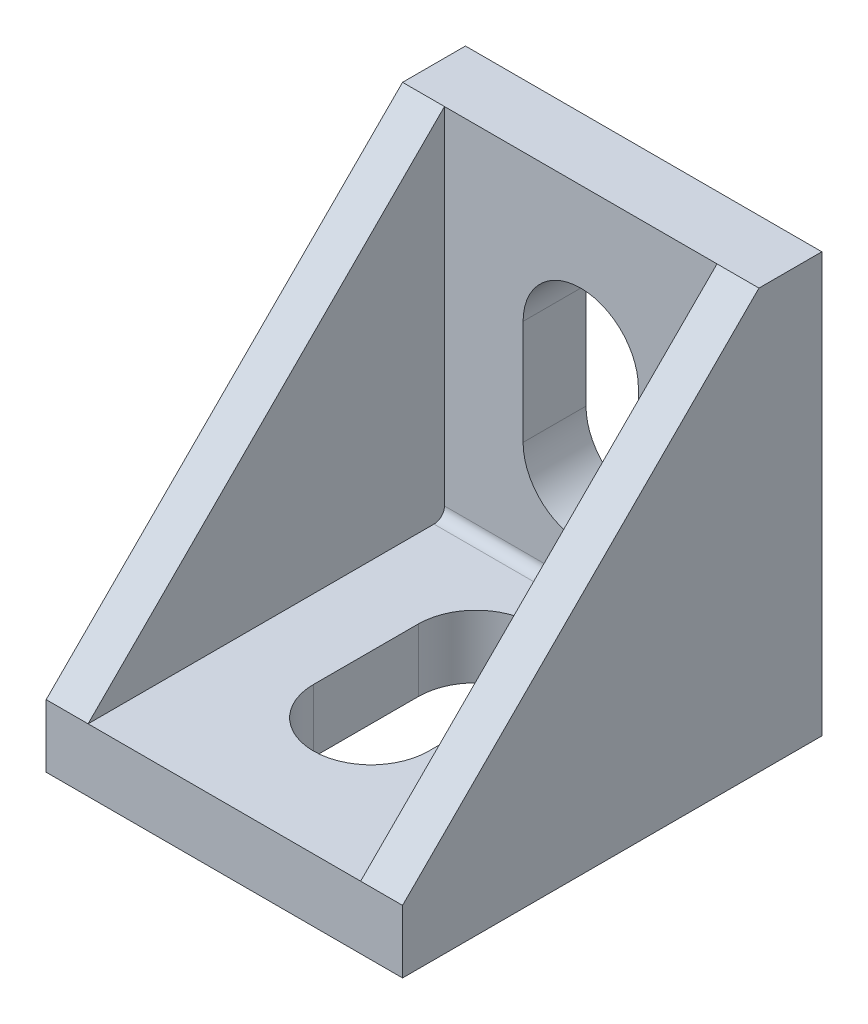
from build123d import *

# Parameters (mm, degrees)
BOSS_EXTRUDE1_DEPTH = 17
SKETCH17_W          = 17
SKETCH17_H          = 17
BOSS_EXTRUDE2_DEPTH = 3
CUT_EXTRUDE1_DEPTH  = 13
SKETCH23_W          = 17
SKETCH23_H          = 20
BOSS_EXTRUDE3_DEPTH = 3
SKETCH24_W          = 12
SKETCH24_H          = 1
CUT_EXTRUDE2_DEPTH  = 3
CUT_EXTRUDE3_REACH  = 29.591
SKETCH30_W          = 12
SKETCH30_H          = 1
CUT_EXTRUDE4_DEPTH  = 28.590759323
CUT_EXTRUDE5_DEPTH  = 28.590759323
SKETCH39_W          = 12
SKETCH39_H          = 3
CUT_EXTRUDE6_DEPTH  = 1
SKETCH40_W          = 6
SKETCH40_H          = 1
BOSS_EXTRUDE4_DEPTH = 2.5
SKETCH41_W          = 6
SKETCH41_H          = 1
BOSS_EXTRUDE5_DEPTH = 2.5
BOSS_EXTRUDE6_REACH = 32.57
SKETCH49_W          = 6
SKETCH49_H          = 1
SKETCH50_W          = 12
SKETCH50_H          = 3
CUT_EXTRUDE7_DEPTH  = 1
SKETCH51_W          = 6
SKETCH51_H          = 1
BOSS_EXTRUDE7_DEPTH = 2.5
FILLET1_R           = 0.5


with BuildPart() as part:
    # Sketch16 → Boss-Extrude1 (new body)
    with BuildSketch(Plane(origin=(8.5, 0, 0), x_dir=(0, 0, -1), z_dir=(1, 0, 0))):
        Polygon((-3, 3), (-3, 20), (-20, 3), align=None)
    extrude(amount=-BOSS_EXTRUDE1_DEPTH)

    # Sketch17 → Boss-Extrude2 (add)
    with BuildSketch(Plane(origin=(0, 0, 3), x_dir=(-1, 0, 0), z_dir=(0, 0, -1))):
        with Locations((0, 11.5)):
            Rectangle(SKETCH17_W, SKETCH17_H)
    extrude(amount=BOSS_EXTRUDE2_DEPTH)

    # Sketch22 → Cut-Extrude1 (cut)
    with BuildSketch(Plane(origin=(6.5, 0, 0), x_dir=(0, 0, -1), z_dir=(1, 0, 0))):
        Polygon((-3, 20), (-20, 3), (-3, 3), align=None)
    extrude(amount=-CUT_EXTRUDE1_DEPTH, mode=Mode.SUBTRACT)

    # Sketch23 → Boss-Extrude3 (add)
    with BuildSketch(Plane.XZ.offset(-3)):
        with Locations((0, 10)):
            Rectangle(SKETCH23_W, SKETCH23_H)
    extrude(amount=BOSS_EXTRUDE3_DEPTH)

    # Sketch24 → Cut-Extrude2 (cut)
    with BuildSketch(Plane.XZ):
        with Locations((0, 0.5)):
            Rectangle(SKETCH24_W, SKETCH24_H)
    extrude(amount=-CUT_EXTRUDE2_DEPTH, mode=Mode.SUBTRACT)

    # Sketch30 → Cut-Extrude3 (cut, up to next)
    with BuildSketch(Plane.XY.offset(3), mode=Mode.PRIVATE) as cut_extrude3_sk1:
        with Locations((0, 0.5)):
            Rectangle(SKETCH30_W, SKETCH30_H)
    cut_extrude3_tool1 = extrude(cut_extrude3_sk1.sketch, amount=-CUT_EXTRUDE3_REACH, mode=Mode.PRIVATE) & part.part
    add(cut_extrude3_tool1.solids().sort_by_distance((0, 0.5, 3))[0], mode=Mode.SUBTRACT)

    # Sketch37 → Cut-Extrude4 (cut, through all)
    with BuildSketch(Plane.XY.offset(3)):
        with BuildLine():
            Line((2.75, 8), (2.75, 13))
            ThreePointArc((2.75, 13), (0, 15.75), (-2.75, 13))
            Line((-2.75, 13), (-2.75, 8))
            ThreePointArc((-2.75, 8), (0, 5.25), (2.75, 8))
        make_face()
    extrude(amount=-CUT_EXTRUDE4_DEPTH, mode=Mode.SUBTRACT)

    # Sketch38 → Cut-Extrude5 (cut, through all)
    with BuildSketch(Plane(origin=(0, 3, 0), x_dir=(-1, 0, 0), z_dir=(0, 1, 0))):
        with BuildLine():
            Line((-2.75, 13), (-2.75, 8))
            ThreePointArc((-2.75, 8), (0, 5.25), (2.75, 8))
            Line((2.75, 8), (2.75, 13))
            ThreePointArc((2.75, 13), (0, 15.75), (-2.75, 13))
        make_face()
    extrude(amount=-CUT_EXTRUDE5_DEPTH, mode=Mode.SUBTRACT)

    # Sketch39 → Cut-Extrude6 (cut)
    with BuildSketch(Plane.XZ):
        with Locations((0, 17.5)):
            Rectangle(SKETCH39_W, SKETCH39_H)
    extrude(amount=-CUT_EXTRUDE6_DEPTH, mode=Mode.SUBTRACT)

    # Sketch40 → Boss-Extrude4 (add)
    with BuildSketch(Plane.XZ.offset(-1)):
        with Locations((0, 17.5)):
            Rectangle(SKETCH40_W, SKETCH40_H)
    extrude(amount=BOSS_EXTRUDE4_DEPTH)

    # Sketch41 → Boss-Extrude5 (add)
    with BuildSketch(Plane.XZ.offset(-1)):
        with Locations((0, 1.5)):
            Rectangle(SKETCH41_W, SKETCH41_H)
    extrude(amount=BOSS_EXTRUDE5_DEPTH)

    # Sketch49 → Boss-Extrude6 (add, up to next)
    with BuildSketch(Plane(origin=(0, 0, -1.5), x_dir=(-1, 0, 0), z_dir=(0, 0, -1)), mode=Mode.PRIVATE) as boss_extrude6_sk1:
        with Locations((0, 1.5)):
            Rectangle(SKETCH49_W, SKETCH49_H)
    boss_extrude6_tool1 = extrude(boss_extrude6_sk1.sketch, amount=-BOSS_EXTRUDE6_REACH, mode=Mode.PRIVATE) - part.part
    add(boss_extrude6_tool1.solids().sort_by_distance((0, 1.5, -1.5))[0])

    # Sketch50 → Cut-Extrude7 (cut)
    with BuildSketch(Plane(origin=(0, 0, 0), x_dir=(-1, 0, 0), z_dir=(0, 0, -1))):
        with Locations((0, 17.5)):
            Rectangle(SKETCH50_W, SKETCH50_H)
    extrude(amount=-CUT_EXTRUDE7_DEPTH, mode=Mode.SUBTRACT)

    # Sketch51 → Boss-Extrude7 (add)
    with BuildSketch(Plane(origin=(0, 0, 1), x_dir=(-1, 0, 0), z_dir=(0, 0, -1))):
        with Locations((0, 17.5)):
            Rectangle(SKETCH51_W, SKETCH51_H)
    extrude(amount=BOSS_EXTRUDE7_DEPTH)

    # Fillet1
    fillet1_edges = [part.edges().sort_by_distance(p)[0] for p in [
        (0, 3, 3),
    ]]
    fillet(fillet1_edges, radius=FILLET1_R)


solid = part.part
